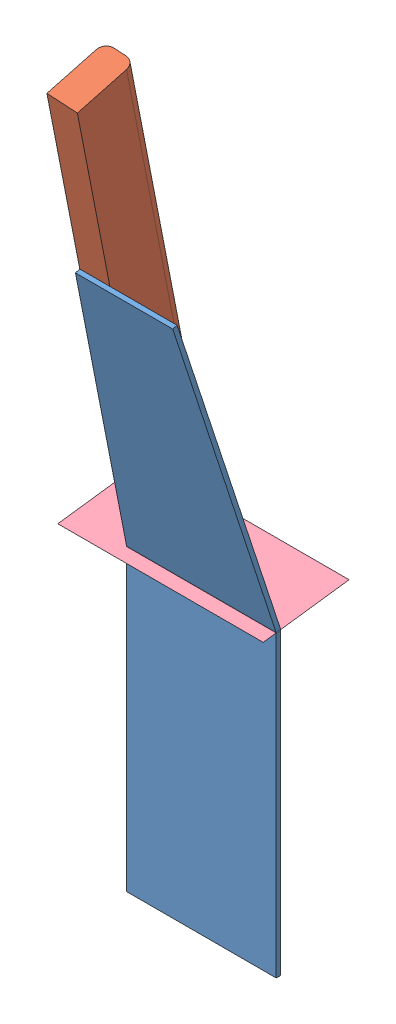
SolidWorks assembly Gehrung tm.SLDASM, configuration Standard (file format 3400). Lengths in mm.
Overall size (68.65 263.93 65.36).
4 component instances, 4 part files, 8 mates.
Components (placement in the parent):
- Blech-1: Blech.SLDPRT [Standard] at (-26.6889 -66.1648 -13.6784) size (50.01 196.79 27.36)
- Leiste 2-3: Leiste 2.SLDPRT [Standard] at (-12.328 192.5851 28.8316) x (0.996195 -0.084186 -0.022558) z (0.087156 0.96225 0.257834) size (10 20 167.33)
- Leiste 1-3: Leiste 1.SLDPRT [Standard] at (-26.6889 -60.0743 -13.6784) x (1 0 0) z (0 1 0) size (10 20 96.64)
- TRENNFLAECHE-1: TRENNFLAECHE.SLDPRT [Standard] at (23.3111 -66.1648 -13.6784) x (0 0 -1) z (1 0 0) size (28.7 3.78 68.65)
Mates (geometry in assembly coordinates):
- Deckungsgleich1: coincident aligned: plane of Blech-1 through (-26.6889 33.6444 -12.2035) normal (-0.996195 0.084186 0.022558); plane of ? through (-39.1143 -103.1511 -50.4106) normal (-0.996195 0.084186 0.022558)
- Deckungsgleich2: coincident anti-aligned: plane of Blech-1 through (-26.6889 130.6252 12.2295) normal (0 0.258819 -0.965926); plane of ? through (-39.1143 -103.1511 -50.4106) normal (0 -0.258819 0.965926)
- Deckungsgleich3: coincident anti-aligned: plane of Blech-1 through (-26.6889 133.8352 -13.6784) normal (0 0 -1); plane of Leiste 1-3 through (-26.6889 57.7093 -13.6784) normal (0 0 1)
- Deckungsgleich4: coincident aligned: plane of Blech-1 through (-26.6889 -66.1648 -12.1784) normal (-1 0 0); plane of Leiste 1-3 through (-26.6889 57.7093 -13.6784) normal (-1 0 0)
- Platziert1: in place: moOrthogonalPlaneRef_w of Blech-1; unknown of TRENNFLAECHE-1
- Deckungsgleich5: coincident aligned: plane of ?; plane of ?
- Deckungsgleich6: coincident aligned: moOrthogonalPlaneRef_w of ?; plane of ?
- Deckungsgleich7: coincident anti-aligned: moOrthogonalPlaneRef_w of ?; plane of ?
